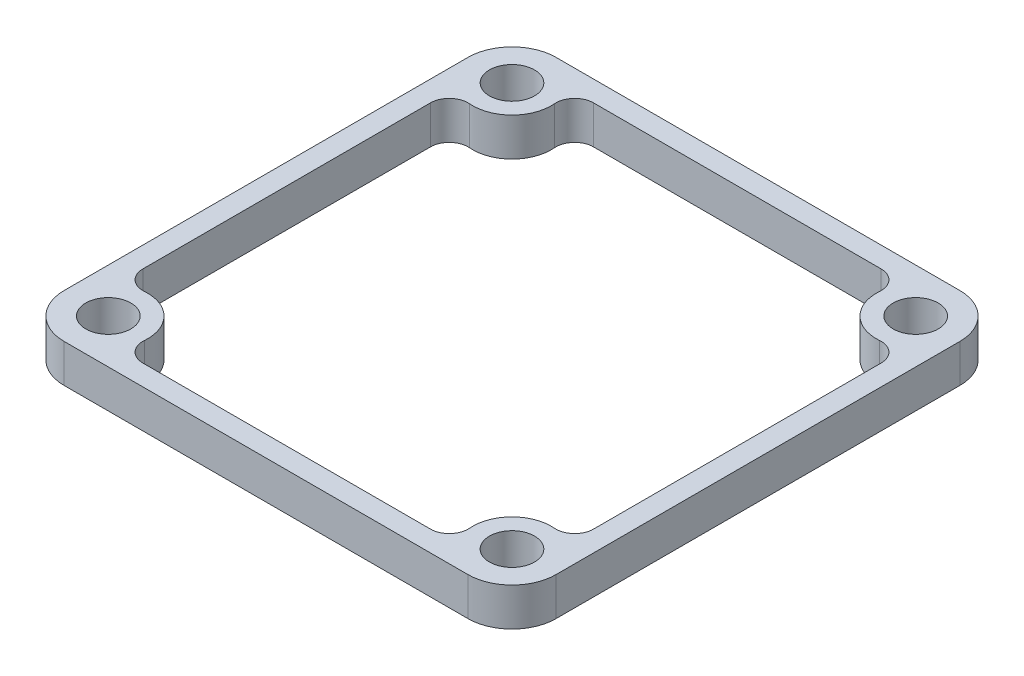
from build123d import *

# Parameters (mm, degrees)
SKETCH1_R             = 2.1
SKETCH1_R_2           = 1.2
BOSS_EXTRUDE1_DEPTH   = 2.032
BOSS_EXTRUDE1_2_DEPTH = 2.032
BOSS_EXTRUDE1_3_DEPTH = 2.032
BOSS_EXTRUDE1_4_DEPTH = 2.032
BOSS_EXTRUDE3_DEPTH   = 2.032
FILLET1_R             = 1
FILLET2_R             = 1
FILLET3_R             = 1
FILLET4_R             = 1
FILLET5_R             = 1
FILLET6_R             = 1
FILLET7_R             = 1
FILLET8_R             = 1


with BuildPart() as part:
    # Sketch1 → Boss-Extrude1 (new body)
    with BuildSketch(Plane(origin=(0, 0, 0), x_dir=(1, 0, 0), z_dir=(0, 1, 0))):
        with Locations(Location((0, 21.5, 0), (0, 0, 270))):
            Circle(SKETCH1_R)
        with Locations(Location((0, 21.5, 0), (0, 0, 270))):
            Circle(SKETCH1_R_2, mode=Mode.SUBTRACT)
    extrude(amount=BOSS_EXTRUDE1_DEPTH)



with BuildPart() as body_2:
    # Sketch1 → Boss-Extrude1 2 (new body)
    with BuildSketch(Plane(origin=(0, 0, 0), x_dir=(1, 0, 0), z_dir=(0, 1, 0))):
        with Locations(Location((21.5, 21.5, 0), (0, 0, 270))):
            Circle(SKETCH1_R)
        with Locations(Location((21.5, 21.5, 0), (0, 0, 270))):
            Circle(SKETCH1_R_2, mode=Mode.SUBTRACT)
    extrude(amount=BOSS_EXTRUDE1_2_DEPTH)


with BuildPart() as body_3:
    # Sketch1 → Boss-Extrude1 3 (new body)
    with BuildSketch(Plane(origin=(0, 0, 0), x_dir=(1, 0, 0), z_dir=(0, 1, 0))):
        with Locations(Location((21.5, 0, 0), (0, 0, 270))):
            Circle(SKETCH1_R)
        with Locations(Location((21.5, 0, 0), (0, 0, 270))):
            Circle(SKETCH1_R_2, mode=Mode.SUBTRACT)
    extrude(amount=BOSS_EXTRUDE1_3_DEPTH)


with BuildPart() as body_4:
    # Sketch1 → Boss-Extrude1 4 (new body)
    with BuildSketch(Plane(origin=(0, 0, 0), x_dir=(1, 0, 0), z_dir=(0, 1, 0))):
        with Locations(Location((0, 0, 0), (0, 0, 270))):
            Circle(SKETCH1_R)
        with Locations(Location((0, 0, 0), (0, 0, 270))):
            Circle(SKETCH1_R_2, mode=Mode.SUBTRACT)
    extrude(amount=BOSS_EXTRUDE1_4_DEPTH)


with BuildPart() as part_1:
    add(part.part)

    add(body_2.part)  # Boss-Extrude3 merges body 2

    add(body_3.part)  # Boss-Extrude3 merges body 3

    add(body_4.part)  # Boss-Extrude3 merges body 4
    # Sketch5 → Boss-Extrude3 (add)
    with BuildSketch(Plane(origin=(0, 2.032, 0), x_dir=(1, 0, 0), z_dir=(0, 1, 0))):
        with BuildLine():
            Line((-2.35, 0), (-2.35, 21.5))
            ThreePointArc((-2.35, 21.5), (-1.661700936, 23.161700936), (0, 23.85))
            Line((0, 23.85), (21.5, 23.85))
            ThreePointArc((21.5, 23.85), (23.161700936, 23.161700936), (23.85, 21.5))
            Line((23.85, 21.5), (23.85, 0))
            ThreePointArc((23.85, 0), (23.161700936, -1.661700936), (21.5, -2.35))
            Line((21.5, -2.35), (0, -2.35))
            ThreePointArc((0, -2.35), (-1.661700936, -1.661700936), (-2.35, 0))
        make_face()
        with BuildLine():
            Line((-1.25, 0), (-1.25, 21.5))
            ThreePointArc((-1.25, 21.5), (-0.883883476, 22.383883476), (0, 22.75))
            Line((0, 22.75), (21.5, 22.75))
            ThreePointArc((21.5, 22.75), (22.383883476, 22.383883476), (22.75, 21.5))
            Line((22.75, 21.5), (22.75, 0))
            ThreePointArc((22.75, 0), (22.383883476, -0.883883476), (21.5, -1.25))
            Line((21.5, -1.25), (0, -1.25))
            ThreePointArc((0, -1.25), (-0.883883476, -0.883883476), (-1.25, 0))
        make_face(mode=Mode.SUBTRACT)
    extrude(amount=-BOSS_EXTRUDE3_DEPTH)

    # Fillet1
    fillet1_edges = [part_1.edges().sort_by_distance(p)[0] for p in [
        (19.812546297, 1.016, -22.75),
    ]]
    fillet(fillet1_edges, radius=FILLET1_R)

    # Fillet2
    fillet2_edges = [part_1.edges().sort_by_distance(p)[0] for p in [
        (1.687453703, 1.016, -22.75),
    ]]
    fillet(fillet2_edges, radius=FILLET2_R)

    # Fillet3
    fillet3_edges = [part_1.edges().sort_by_distance(p)[0] for p in [
        (-1.25, 1.016, -19.812546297),
    ]]
    fillet(fillet3_edges, radius=FILLET3_R)

    # Fillet4
    fillet4_edges = [part_1.edges().sort_by_distance(p)[0] for p in [
        (-1.25, 1.016, -1.687453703),
    ]]
    fillet(fillet4_edges, radius=FILLET4_R)

    # Fillet5
    fillet5_edges = [part_1.edges().sort_by_distance(p)[0] for p in [
        (1.687453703, 1.016, 1.25),
    ]]
    fillet(fillet5_edges, radius=FILLET5_R)

    # Fillet6
    fillet6_edges = [part_1.edges().sort_by_distance(p)[0] for p in [
        (19.812546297, 1.016, 1.25),
    ]]
    fillet(fillet6_edges, radius=FILLET6_R)

    # Fillet7
    fillet7_edges = [part_1.edges().sort_by_distance(p)[0] for p in [
        (22.75, 1.016, -1.687453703),
    ]]
    fillet(fillet7_edges, radius=FILLET7_R)

    # Fillet8
    fillet8_edges = [part_1.edges().sort_by_distance(p)[0] for p in [
        (22.75, 1.016, -19.812546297),
    ]]
    fillet(fillet8_edges, radius=FILLET8_R)


solid = part_1.part
